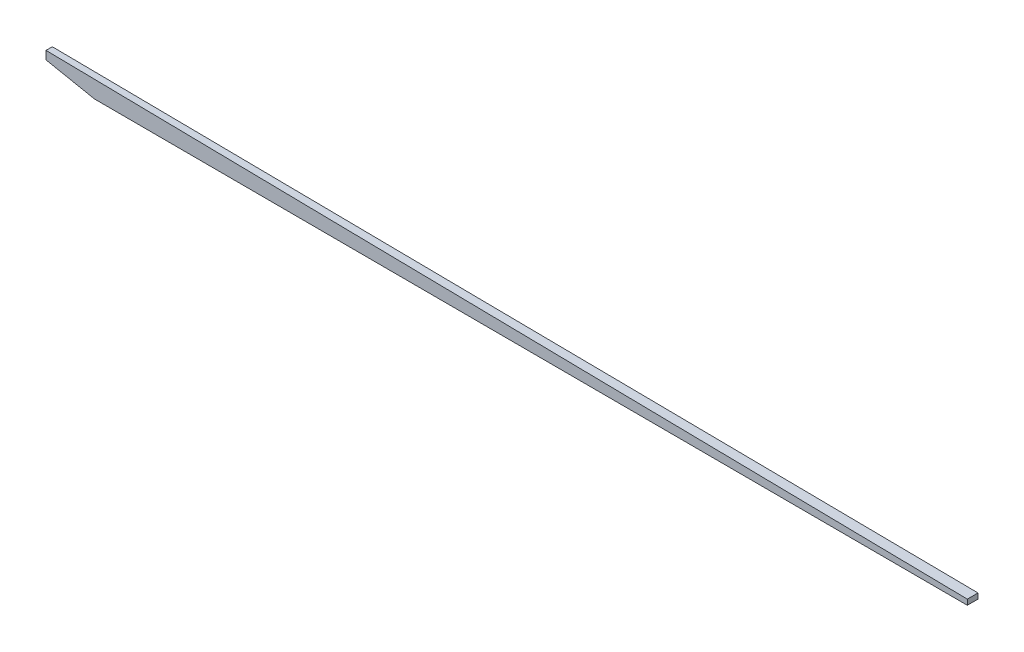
ISO-10303-21;
HEADER;
FILE_DESCRIPTION(('STEP AP214'),'2;1');
FILE_NAME('part.step','',(''),(''),'','','');
FILE_SCHEMA(('AUTOMOTIVE_DESIGN { 1 0 10303 214 1 1 1 1 }'));
ENDSEC;
DATA;
#1=APPLICATION_CONTEXT('core data for automotive mechanical design processes');
#2=APPLICATION_PROTOCOL_DEFINITION('international standard','automotive_design',2000,#1);
#3=PRODUCT_CONTEXT('',#1,'mechanical');
#4=PRODUCT('Part','Part','',(#3));
#5=PRODUCT_RELATED_PRODUCT_CATEGORY('part','',(#4));
#6=PRODUCT_DEFINITION_FORMATION('','',#4);
#7=PRODUCT_DEFINITION_CONTEXT('part definition',#1,'design');
#8=PRODUCT_DEFINITION('design','',#6,#7);
#9=PRODUCT_DEFINITION_SHAPE('','',#8);
#10=(LENGTH_UNIT() NAMED_UNIT(*) SI_UNIT(.MILLI.,.METRE.));
#11=(NAMED_UNIT(*) PLANE_ANGLE_UNIT() SI_UNIT($,.RADIAN.));
#12=(NAMED_UNIT(*) SI_UNIT($,.STERADIAN.) SOLID_ANGLE_UNIT());
#13=UNCERTAINTY_MEASURE_WITH_UNIT(LENGTH_MEASURE(1.E-05),#10,'distance_accuracy_value','');
#14=(GEOMETRIC_REPRESENTATION_CONTEXT(3) GLOBAL_UNCERTAINTY_ASSIGNED_CONTEXT((#13)) GLOBAL_UNIT_ASSIGNED_CONTEXT((#10,
#11,#12)) REPRESENTATION_CONTEXT('',''));
#15=CARTESIAN_POINT('',(0.,0.,0.));
#16=DIRECTION('',(0.,0.,1.));
#17=DIRECTION('',(1.,0.,0.));
#18=AXIS2_PLACEMENT_3D('',#15,#16,#17);
#19=CARTESIAN_POINT('',(1900.,11.,50.));
#20=DIRECTION('',(-0.0134198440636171,-0.999909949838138,0.));
#21=DIRECTION('',(0.999909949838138,-0.0134198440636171,0.));
#22=AXIS2_PLACEMENT_3D('',#19,#20,#21);
#23=PLANE('',#22);
#24=DIRECTION('',(0.999907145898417,-0.0134198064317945,-0.00236820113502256));
#25=VECTOR('',#24,1.);
#26=CARTESIAN_POINT('',(0.,36.5,-6.5));
#27=LINE('',#26,#25);
#28=CARTESIAN_POINT('',(0.,36.5,-6.5));
#29=VERTEX_POINT('',#28);
#30=CARTESIAN_POINT('',(1900.,11.,-11.));
#31=VERTEX_POINT('',#30);
#32=EDGE_CURVE('E7',#29,#31,#27,.T.);
#33=ORIENTED_EDGE('',*,*,#32,.F.);
#34=DIRECTION('',(0.,0.,-1.));
#35=VECTOR('',#34,1.);
#36=CARTESIAN_POINT('',(0.,36.5,6.5));
#37=LINE('',#36,#35);
#38=CARTESIAN_POINT('',(2.22044604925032E-13,36.5,6.5));
#39=VERTEX_POINT('',#38);
#40=EDGE_CURVE('E14',#39,#29,#37,.T.);
#41=ORIENTED_EDGE('',*,*,#40,.F.);
#42=DIRECTION('',(-0.999907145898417,0.0134198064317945,-0.00236820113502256));
#43=VECTOR('',#42,1.);
#44=CARTESIAN_POINT('',(1900.,11.,11.));
#45=LINE('',#44,#43);
#46=CARTESIAN_POINT('',(1900.,11.,11.));
#47=VERTEX_POINT('',#46);
#48=EDGE_CURVE('E21',#47,#39,#45,.T.);
#49=ORIENTED_EDGE('',*,*,#48,.F.);
#50=DIRECTION('',(0.,0.,-1.));
#51=VECTOR('',#50,1.);
#52=CARTESIAN_POINT('',(1900.,11.,11.));
#53=LINE('',#52,#51);
#54=EDGE_CURVE('E28',#47,#31,#53,.T.);
#55=ORIENTED_EDGE('',*,*,#54,.T.);
#56=EDGE_LOOP('',(#33,#41,#49,#55));
#57=FACE_BOUND('',#56,.T.);
#58=ADVANCED_FACE('F34',(#57),#23,.F.);
#59=CARTESIAN_POINT('',(0.,36.5,50.));
#60=DIRECTION('',(1.,0.,0.));
#61=DIRECTION('',(0.,0.,-1.));
#62=AXIS2_PLACEMENT_3D('',#59,#60,#61);
#63=PLANE('',#62);
#64=DIRECTION('',(0.,-1.,0.));
#65=VECTOR('',#64,1.);
#66=CARTESIAN_POINT('',(0.,36.5,-6.5));
#67=LINE('',#66,#65);
#68=CARTESIAN_POINT('',(0.,19.5,-6.5));
#69=VERTEX_POINT('',#68);
#70=EDGE_CURVE('E47',#29,#69,#67,.T.);
#71=ORIENTED_EDGE('',*,*,#70,.T.);
#72=DIRECTION('',(0.,0.,-1.));
#73=VECTOR('',#72,1.);
#74=CARTESIAN_POINT('',(0.,19.5,6.5));
#75=LINE('',#74,#73);
#76=CARTESIAN_POINT('',(2.2187519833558E-13,19.5,6.5));
#77=VERTEX_POINT('',#76);
#78=EDGE_CURVE('E54',#77,#69,#75,.T.);
#79=ORIENTED_EDGE('',*,*,#78,.F.);
#80=DIRECTION('',(0.,-1.,0.));
#81=VECTOR('',#80,1.);
#82=CARTESIAN_POINT('',(2.22044604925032E-13,36.5,6.5));
#83=LINE('',#82,#81);
#84=EDGE_CURVE('E61',#39,#77,#83,.T.);
#85=ORIENTED_EDGE('',*,*,#84,.F.);
#86=ORIENTED_EDGE('',*,*,#40,.T.);
#87=EDGE_LOOP('',(#71,#79,#85,#86));
#88=FACE_BOUND('',#87,.T.);
#89=ADVANCED_FACE('F66',(#88),#63,.F.);
#90=CARTESIAN_POINT('',(0.,19.5,50.));
#91=DIRECTION('',(0.191395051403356,0.981513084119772,0.));
#92=DIRECTION('',(-0.981513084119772,0.191395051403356,0.));
#93=AXIS2_PLACEMENT_3D('',#90,#91,#92);
#94=PLANE('',#93);
#95=DIRECTION('',(-0.981510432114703,0.191394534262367,0.00232462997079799));
#96=VECTOR('',#95,1.);
#97=CARTESIAN_POINT('',(100.,0.,-6.73684210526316));
#98=LINE('',#97,#96);
#99=CARTESIAN_POINT('',(100.,0.,-6.73684210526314));
#100=VERTEX_POINT('',#99);
#101=EDGE_CURVE('E75',#100,#69,#98,.T.);
#102=ORIENTED_EDGE('',*,*,#101,.F.);
#103=DIRECTION('',(0.,0.,-1.));
#104=VECTOR('',#103,1.);
#105=CARTESIAN_POINT('',(100.,0.,6.73684210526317));
#106=LINE('',#105,#104);
#107=CARTESIAN_POINT('',(100.,0.,6.73684210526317));
#108=VERTEX_POINT('',#107);
#109=EDGE_CURVE('E82',#108,#100,#106,.T.);
#110=ORIENTED_EDGE('',*,*,#109,.F.);
#111=DIRECTION('',(0.981510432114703,-0.191394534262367,0.00232462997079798));
#112=VECTOR('',#111,1.);
#113=CARTESIAN_POINT('',(2.14619988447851E-13,19.5,6.5));
#114=LINE('',#113,#112);
#115=EDGE_CURVE('E89',#77,#108,#114,.T.);
#116=ORIENTED_EDGE('',*,*,#115,.F.);
#117=ORIENTED_EDGE('',*,*,#78,.T.);
#118=EDGE_LOOP('',(#102,#110,#116,#117));
#119=FACE_BOUND('',#118,.T.);
#120=ADVANCED_FACE('F94',(#119),#94,.F.);
#121=CARTESIAN_POINT('',(100.,0.,50.));
#122=DIRECTION('',(0.,1.,0.));
#123=DIRECTION('',(0.,0.,1.));
#124=AXIS2_PLACEMENT_3D('',#121,#122,#123);
#125=PLANE('',#124);
#126=DIRECTION('',(-0.999997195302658,0.,0.00236841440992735));
#127=VECTOR('',#126,1.);
#128=CARTESIAN_POINT('',(1900.,0.,-11.));
#129=LINE('',#128,#127);
#130=CARTESIAN_POINT('',(1900.,0.,-11.));
#131=VERTEX_POINT('',#130);
#132=EDGE_CURVE('E103',#131,#100,#129,.T.);
#133=ORIENTED_EDGE('',*,*,#132,.F.);
#134=DIRECTION('',(0.,0.,-1.));
#135=VECTOR('',#134,1.);
#136=CARTESIAN_POINT('',(1900.,0.,11.));
#137=LINE('',#136,#135);
#138=CARTESIAN_POINT('',(1900.,0.,11.));
#139=VERTEX_POINT('',#138);
#140=EDGE_CURVE('E110',#139,#131,#137,.T.);
#141=ORIENTED_EDGE('',*,*,#140,.F.);
#142=DIRECTION('',(0.999997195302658,0.,0.00236841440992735));
#143=VECTOR('',#142,1.);
#144=CARTESIAN_POINT('',(100.,0.,6.73684210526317));
#145=LINE('',#144,#143);
#146=EDGE_CURVE('E117',#108,#139,#145,.T.);
#147=ORIENTED_EDGE('',*,*,#146,.F.);
#148=ORIENTED_EDGE('',*,*,#109,.T.);
#149=EDGE_LOOP('',(#133,#141,#147,#148));
#150=FACE_BOUND('',#149,.T.);
#151=ADVANCED_FACE('F122',(#150),#125,.F.);
#152=CARTESIAN_POINT('',(1900.,0.,50.));
#153=DIRECTION('',(-1.,0.,0.));
#154=DIRECTION('',(0.,0.,1.));
#155=AXIS2_PLACEMENT_3D('',#152,#153,#154);
#156=PLANE('',#155);
#157=DIRECTION('',(0.,-1.,0.));
#158=VECTOR('',#157,1.);
#159=CARTESIAN_POINT('',(1900.,11.,-11.));
#160=LINE('',#159,#158);
#161=EDGE_CURVE('E131',#31,#131,#160,.T.);
#162=ORIENTED_EDGE('',*,*,#161,.F.);
#163=ORIENTED_EDGE('',*,*,#54,.F.);
#164=DIRECTION('',(0.,-1.,0.));
#165=VECTOR('',#164,1.);
#166=CARTESIAN_POINT('',(1900.,11.,11.));
#167=LINE('',#166,#165);
#168=EDGE_CURVE('E137',#47,#139,#167,.T.);
#169=ORIENTED_EDGE('',*,*,#168,.T.);
#170=ORIENTED_EDGE('',*,*,#140,.T.);
#171=EDGE_LOOP('',(#162,#163,#169,#170));
#172=FACE_BOUND('',#171,.T.);
#173=ADVANCED_FACE('F142',(#172),#156,.F.);
#174=CARTESIAN_POINT('',(1900.,50.,11.));
#175=DIRECTION('',(-0.00236841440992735,0.,0.999997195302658));
#176=DIRECTION('',(0.999997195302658,0.,0.00236841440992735));
#177=AXIS2_PLACEMENT_3D('',#174,#175,#176);
#178=PLANE('',#177);
#179=ORIENTED_EDGE('',*,*,#48,.T.);
#180=ORIENTED_EDGE('',*,*,#84,.T.);
#181=ORIENTED_EDGE('',*,*,#115,.T.);
#182=ORIENTED_EDGE('',*,*,#146,.T.);
#183=ORIENTED_EDGE('',*,*,#168,.F.);
#184=EDGE_LOOP('',(#179,#180,#181,#182,#183));
#185=FACE_BOUND('',#184,.T.);
#186=ADVANCED_FACE('F155',(#185),#178,.T.);
#187=CARTESIAN_POINT('',(0.,50.,-6.5));
#188=DIRECTION('',(-0.00236841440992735,0.,-0.999997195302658));
#189=DIRECTION('',(-0.999997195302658,0.,0.00236841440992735));
#190=AXIS2_PLACEMENT_3D('',#187,#188,#189);
#191=PLANE('',#190);
#192=ORIENTED_EDGE('',*,*,#32,.T.);
#193=ORIENTED_EDGE('',*,*,#161,.T.);
#194=ORIENTED_EDGE('',*,*,#132,.T.);
#195=ORIENTED_EDGE('',*,*,#101,.T.);
#196=ORIENTED_EDGE('',*,*,#70,.F.);
#197=EDGE_LOOP('',(#192,#193,#194,#195,#196));
#198=FACE_BOUND('',#197,.T.);
#199=ADVANCED_FACE('F168',(#198),#191,.T.);
#200=CLOSED_SHELL('',(#58,#89,#120,#151,#173,#186,#199));
#201=MANIFOLD_SOLID_BREP('B1',#200);
#202=ADVANCED_BREP_SHAPE_REPRESENTATION('',(#18,#201),#14);
#203=SHAPE_DEFINITION_REPRESENTATION(#9,#202);
ENDSEC;
END-ISO-10303-21;
